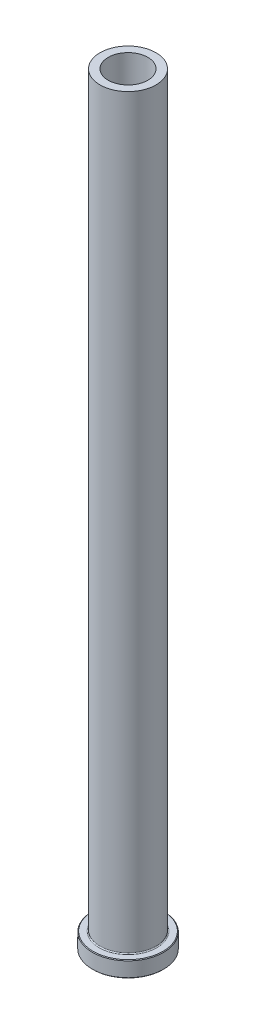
ISO-10303-21;
HEADER;
FILE_DESCRIPTION(('STEP AP214'),'2;1');
FILE_NAME('part.step','',(''),(''),'','','');
FILE_SCHEMA(('AUTOMOTIVE_DESIGN { 1 0 10303 214 1 1 1 1 }'));
ENDSEC;
DATA;
#1=APPLICATION_CONTEXT('core data for automotive mechanical design processes');
#2=APPLICATION_PROTOCOL_DEFINITION('international standard','automotive_design',2000,#1);
#3=PRODUCT_CONTEXT('',#1,'mechanical');
#4=PRODUCT('Part','Part','',(#3));
#5=PRODUCT_RELATED_PRODUCT_CATEGORY('part','',(#4));
#6=PRODUCT_DEFINITION_FORMATION('','',#4);
#7=PRODUCT_DEFINITION_CONTEXT('part definition',#1,'design');
#8=PRODUCT_DEFINITION('design','',#6,#7);
#9=PRODUCT_DEFINITION_SHAPE('','',#8);
#10=(LENGTH_UNIT() NAMED_UNIT(*) SI_UNIT(.MILLI.,.METRE.));
#11=(NAMED_UNIT(*) PLANE_ANGLE_UNIT() SI_UNIT($,.RADIAN.));
#12=(NAMED_UNIT(*) SI_UNIT($,.STERADIAN.) SOLID_ANGLE_UNIT());
#13=UNCERTAINTY_MEASURE_WITH_UNIT(LENGTH_MEASURE(1.E-05),#10,'distance_accuracy_value','');
#14=(GEOMETRIC_REPRESENTATION_CONTEXT(3) GLOBAL_UNCERTAINTY_ASSIGNED_CONTEXT((#13)) GLOBAL_UNIT_ASSIGNED_CONTEXT((#10,
#11,#12)) REPRESENTATION_CONTEXT('',''));
#15=CARTESIAN_POINT('',(0.,0.,0.));
#16=DIRECTION('',(0.,0.,1.));
#17=DIRECTION('',(1.,0.,0.));
#18=AXIS2_PLACEMENT_3D('',#15,#16,#17);
#19=CARTESIAN_POINT('',(0.,0.,0.));
#20=DIRECTION('',(0.,-1.,0.));
#21=DIRECTION('',(0.,0.,-1.));
#22=AXIS2_PLACEMENT_3D('',#19,#20,#21);
#23=PLANE('',#22);
#24=CARTESIAN_POINT('',(0.,0.,0.));
#25=DIRECTION('',(0.,-1.,0.));
#26=DIRECTION('',(0.,0.,-1.));
#27=AXIS2_PLACEMENT_3D('',#24,#25,#26);
#28=CIRCLE('',#27,13.97);
#29=CARTESIAN_POINT('',(0.,0.,-13.97));
#30=VERTEX_POINT('',#29);
#31=EDGE_CURVE('E44',#30,#30,#28,.T.);
#32=ORIENTED_EDGE('',*,*,#31,.T.);
#33=EDGE_LOOP('',(#32));
#34=FACE_BOUND('',#33,.T.);
#35=CARTESIAN_POINT('',(0.,0.,0.));
#36=DIRECTION('',(0.,-1.,0.));
#37=DIRECTION('',(0.,0.,-1.));
#38=AXIS2_PLACEMENT_3D('',#35,#36,#37);
#39=CIRCLE('',#38,8.52487500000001);
#40=CARTESIAN_POINT('',(0.,0.,-8.52487500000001));
#41=VERTEX_POINT('',#40);
#42=EDGE_CURVE('E58',#41,#41,#39,.T.);
#43=ORIENTED_EDGE('',*,*,#42,.F.);
#44=EDGE_LOOP('',(#43));
#45=FACE_BOUND('',#44,.T.);
#46=ADVANCED_FACE('F29',(#34,#45),#23,.T.);
#47=CARTESIAN_POINT('',(0.,0.,0.));
#48=DIRECTION('',(0.,-1.,0.));
#49=DIRECTION('',(0.,0.,-1.));
#50=AXIS2_PLACEMENT_3D('',#47,#48,#49);
#51=CYLINDRICAL_SURFACE('',#50,14.224);
#52=CARTESIAN_POINT('',(0.,0.253999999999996,0.));
#53=DIRECTION('',(0.,-1.,0.));
#54=DIRECTION('',(0.,0.,-1.));
#55=AXIS2_PLACEMENT_3D('',#52,#53,#54);
#56=CIRCLE('',#55,14.224);
#57=CARTESIAN_POINT('',(0.,0.253999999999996,-14.224));
#58=VERTEX_POINT('',#57);
#59=EDGE_CURVE('E36',#58,#58,#56,.F.);
#60=ORIENTED_EDGE('',*,*,#59,.T.);
#61=EDGE_LOOP('',(#60));
#62=FACE_BOUND('',#61,.T.);
#63=CARTESIAN_POINT('',(0.,6.096,0.));
#64=DIRECTION('',(0.,1.,0.));
#65=DIRECTION('',(0.,0.,1.));
#66=AXIS2_PLACEMENT_3D('',#63,#64,#65);
#67=CIRCLE('',#66,14.224);
#68=CARTESIAN_POINT('',(0.,6.096,14.224));
#69=VERTEX_POINT('',#68);
#70=EDGE_CURVE('E40',#69,#69,#67,.F.);
#71=ORIENTED_EDGE('',*,*,#70,.T.);
#72=EDGE_LOOP('',(#71));
#73=FACE_BOUND('',#72,.T.);
#74=ADVANCED_FACE('F103',(#62,#73),#51,.T.);
#75=CARTESIAN_POINT('',(14.224,6.35,0.));
#76=DIRECTION('',(0.,1.,0.));
#77=DIRECTION('',(0.,0.,1.));
#78=AXIS2_PLACEMENT_3D('',#75,#76,#77);
#79=PLANE('',#78);
#80=CARTESIAN_POINT('',(0.,6.35,0.));
#81=DIRECTION('',(0.,1.,0.));
#82=DIRECTION('',(0.,0.,1.));
#83=AXIS2_PLACEMENT_3D('',#80,#81,#82);
#84=CIRCLE('',#83,13.97);
#85=CARTESIAN_POINT('',(0.,6.35,13.97));
#86=VERTEX_POINT('',#85);
#87=EDGE_CURVE('E10',#86,#86,#84,.T.);
#88=ORIENTED_EDGE('',*,*,#87,.T.);
#89=EDGE_LOOP('',(#88));
#90=FACE_BOUND('',#89,.T.);
#91=CARTESIAN_POINT('',(0.,6.35,0.));
#92=DIRECTION('',(0.,-1.,0.));
#93=DIRECTION('',(0.,0.,-1.));
#94=AXIS2_PLACEMENT_3D('',#91,#92,#93);
#95=CIRCLE('',#94,11.566525);
#96=CARTESIAN_POINT('',(0.,6.35,-11.566525));
#97=VERTEX_POINT('',#96);
#98=EDGE_CURVE('E49',#97,#97,#95,.T.);
#99=ORIENTED_EDGE('',*,*,#98,.T.);
#100=EDGE_LOOP('',(#99));
#101=FACE_BOUND('',#100,.T.);
#102=ADVANCED_FACE('F109',(#90,#101),#79,.T.);
#103=CARTESIAN_POINT('',(0.,6.746875,0.));
#104=DIRECTION('',(0.,-1.,0.));
#105=DIRECTION('',(0.,0.,-1.));
#106=AXIS2_PLACEMENT_3D('',#103,#104,#105);
#107=TOROIDAL_SURFACE('',#106,11.566525,0.396874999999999);
#108=CARTESIAN_POINT('',(0.,6.746875,0.));
#109=DIRECTION('',(0.,-1.,0.));
#110=DIRECTION('',(0.,0.,-1.));
#111=AXIS2_PLACEMENT_3D('',#108,#109,#110);
#112=CIRCLE('',#111,11.16965);
#113=CARTESIAN_POINT('',(0.,6.746875,-11.16965));
#114=VERTEX_POINT('',#113);
#115=EDGE_CURVE('E52',#114,#114,#112,.T.);
#116=ORIENTED_EDGE('',*,*,#115,.T.);
#117=EDGE_LOOP('',(#116));
#118=FACE_BOUND('',#117,.T.);
#119=ORIENTED_EDGE('',*,*,#98,.F.);
#120=EDGE_LOOP('',(#119));
#121=FACE_BOUND('',#120,.T.);
#122=ADVANCED_FACE('F139',(#118,#121),#107,.F.);
#123=CARTESIAN_POINT('',(0.,0.,0.));
#124=DIRECTION('',(0.,-1.,0.));
#125=DIRECTION('',(0.,0.,-1.));
#126=AXIS2_PLACEMENT_3D('',#123,#124,#125);
#127=CYLINDRICAL_SURFACE('',#126,11.16965);
#128=CARTESIAN_POINT('',(0.,304.8,0.));
#129=DIRECTION('',(0.,-1.,0.));
#130=DIRECTION('',(0.,0.,-1.));
#131=AXIS2_PLACEMENT_3D('',#128,#129,#130);
#132=CIRCLE('',#131,11.16965);
#133=CARTESIAN_POINT('',(0.,304.8,-11.16965));
#134=VERTEX_POINT('',#133);
#135=EDGE_CURVE('E55',#134,#134,#132,.T.);
#136=ORIENTED_EDGE('',*,*,#135,.T.);
#137=EDGE_LOOP('',(#136));
#138=FACE_BOUND('',#137,.T.);
#139=ORIENTED_EDGE('',*,*,#115,.F.);
#140=EDGE_LOOP('',(#139));
#141=FACE_BOUND('',#140,.T.);
#142=ADVANCED_FACE('F182',(#138,#141),#127,.T.);
#143=CARTESIAN_POINT('',(11.16965,304.8,0.));
#144=DIRECTION('',(0.,1.,0.));
#145=DIRECTION('',(0.,0.,1.));
#146=AXIS2_PLACEMENT_3D('',#143,#144,#145);
#147=PLANE('',#146);
#148=CARTESIAN_POINT('',(0.,304.8,0.));
#149=DIRECTION('',(0.,-1.,0.));
#150=DIRECTION('',(0.,0.,-1.));
#151=AXIS2_PLACEMENT_3D('',#148,#149,#150);
#152=CIRCLE('',#151,7.9375);
#153=CARTESIAN_POINT('',(0.,304.8,-7.9375));
#154=VERTEX_POINT('',#153);
#155=EDGE_CURVE('E70',#154,#154,#152,.T.);
#156=ORIENTED_EDGE('',*,*,#155,.T.);
#157=EDGE_LOOP('',(#156));
#158=FACE_BOUND('',#157,.T.);
#159=ORIENTED_EDGE('',*,*,#135,.F.);
#160=EDGE_LOOP('',(#159));
#161=FACE_BOUND('',#160,.T.);
#162=ADVANCED_FACE('F74',(#158,#161),#147,.T.);
#163=CARTESIAN_POINT('',(0.,0.,0.));
#164=DIRECTION('',(0.,-1.,0.));
#165=DIRECTION('',(0.,0.,-1.));
#166=AXIS2_PLACEMENT_3D('',#163,#164,#165);
#167=CONICAL_SURFACE('',#166,8.52487500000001,0.785398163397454);
#168=CARTESIAN_POINT('',(0.,0.396875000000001,0.));
#169=DIRECTION('',(0.,-1.,0.));
#170=DIRECTION('',(0.,0.,-1.));
#171=AXIS2_PLACEMENT_3D('',#168,#169,#170);
#172=CIRCLE('',#171,8.128);
#173=CARTESIAN_POINT('',(0.,0.396875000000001,-8.128));
#174=VERTEX_POINT('',#173);
#175=EDGE_CURVE('E61',#174,#174,#172,.T.);
#176=ORIENTED_EDGE('',*,*,#175,.F.);
#177=EDGE_LOOP('',(#176));
#178=FACE_BOUND('',#177,.T.);
#179=ORIENTED_EDGE('',*,*,#42,.T.);
#180=EDGE_LOOP('',(#179));
#181=FACE_BOUND('',#180,.T.);
#182=ADVANCED_FACE('F93',(#178,#181),#167,.F.);
#183=CARTESIAN_POINT('',(0.,0.,0.));
#184=DIRECTION('',(0.,-1.,0.));
#185=DIRECTION('',(0.,0.,-1.));
#186=AXIS2_PLACEMENT_3D('',#183,#184,#185);
#187=CYLINDRICAL_SURFACE('',#186,8.128);
#188=CARTESIAN_POINT('',(0.,230.3145,0.));
#189=DIRECTION('',(0.,-1.,0.));
#190=DIRECTION('',(0.,0.,-1.));
#191=AXIS2_PLACEMENT_3D('',#188,#189,#190);
#192=CIRCLE('',#191,8.128);
#193=CARTESIAN_POINT('',(0.,230.3145,-8.128));
#194=VERTEX_POINT('',#193);
#195=EDGE_CURVE('E64',#194,#194,#192,.T.);
#196=ORIENTED_EDGE('',*,*,#195,.F.);
#197=EDGE_LOOP('',(#196));
#198=FACE_BOUND('',#197,.T.);
#199=ORIENTED_EDGE('',*,*,#175,.T.);
#200=EDGE_LOOP('',(#199));
#201=FACE_BOUND('',#200,.T.);
#202=ADVANCED_FACE('F87',(#198,#201),#187,.F.);
#203=CARTESIAN_POINT('',(0.,230.3145,0.));
#204=DIRECTION('',(0.,-1.,0.));
#205=DIRECTION('',(0.,0.,-1.));
#206=AXIS2_PLACEMENT_3D('',#203,#204,#205);
#207=CONICAL_SURFACE('',#206,8.128,0.0133325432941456);
#208=CARTESIAN_POINT('',(0.,244.602,0.));
#209=DIRECTION('',(0.,-1.,0.));
#210=DIRECTION('',(0.,0.,-1.));
#211=AXIS2_PLACEMENT_3D('',#208,#209,#210);
#212=CIRCLE('',#211,7.9375);
#213=CARTESIAN_POINT('',(0.,244.602,-7.9375));
#214=VERTEX_POINT('',#213);
#215=EDGE_CURVE('E67',#214,#214,#212,.T.);
#216=ORIENTED_EDGE('',*,*,#215,.F.);
#217=EDGE_LOOP('',(#216));
#218=FACE_BOUND('',#217,.T.);
#219=ORIENTED_EDGE('',*,*,#195,.T.);
#220=EDGE_LOOP('',(#219));
#221=FACE_BOUND('',#220,.T.);
#222=ADVANCED_FACE('F81',(#218,#221),#207,.F.);
#223=CARTESIAN_POINT('',(0.,0.,0.));
#224=DIRECTION('',(0.,-1.,0.));
#225=DIRECTION('',(0.,0.,-1.));
#226=AXIS2_PLACEMENT_3D('',#223,#224,#225);
#227=CYLINDRICAL_SURFACE('',#226,7.9375);
#228=ORIENTED_EDGE('',*,*,#155,.F.);
#229=EDGE_LOOP('',(#228));
#230=FACE_BOUND('',#229,.T.);
#231=ORIENTED_EDGE('',*,*,#215,.T.);
#232=EDGE_LOOP('',(#231));
#233=FACE_BOUND('',#232,.T.);
#234=ADVANCED_FACE('F77',(#230,#233),#227,.F.);
#235=CARTESIAN_POINT('',(0.,0.,0.));
#236=DIRECTION('',(0.,1.,0.));
#237=DIRECTION('',(0.,0.,1.));
#238=AXIS2_PLACEMENT_3D('',#235,#236,#237);
#239=CONICAL_SURFACE('',#238,13.97,0.785398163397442);
#240=ORIENTED_EDGE('',*,*,#59,.F.);
#241=EDGE_LOOP('',(#240));
#242=FACE_BOUND('',#241,.T.);
#243=ORIENTED_EDGE('',*,*,#31,.F.);
#244=EDGE_LOOP('',(#243));
#245=FACE_BOUND('',#244,.T.);
#246=ADVANCED_FACE('F80',(#242,#245),#239,.T.);
#247=CARTESIAN_POINT('',(0.,6.096,0.));
#248=DIRECTION('',(0.,-1.,0.));
#249=DIRECTION('',(0.,0.,-1.));
#250=AXIS2_PLACEMENT_3D('',#247,#248,#249);
#251=CONICAL_SURFACE('',#250,14.224,0.785398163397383);
#252=ORIENTED_EDGE('',*,*,#87,.F.);
#253=EDGE_LOOP('',(#252));
#254=FACE_BOUND('',#253,.T.);
#255=ORIENTED_EDGE('',*,*,#70,.F.);
#256=EDGE_LOOP('',(#255));
#257=FACE_BOUND('',#256,.T.);
#258=ADVANCED_FACE('F31',(#254,#257),#251,.T.);
#259=CLOSED_SHELL('',(#46,#74,#102,#122,#142,#162,#182,#202,#222,#234,#246,#258));
#260=MANIFOLD_SOLID_BREP('B2',#259);
#261=ADVANCED_BREP_SHAPE_REPRESENTATION('',(#18,#260),#14);
#262=SHAPE_DEFINITION_REPRESENTATION(#9,#261);
ENDSEC;
END-ISO-10303-21;
